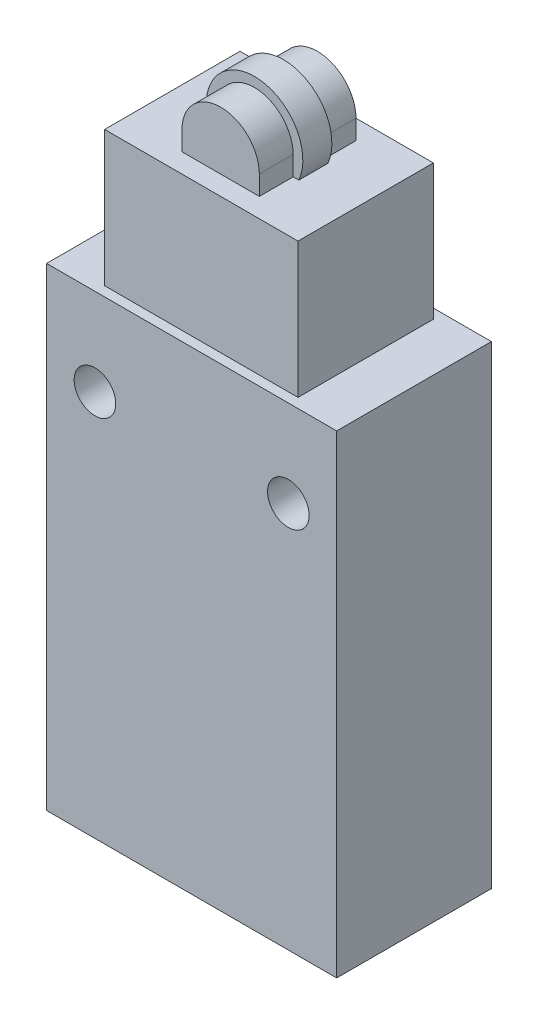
ISO-10303-21;
HEADER;
FILE_DESCRIPTION(('STEP AP214'),'2;1');
FILE_NAME('part.step','',(''),(''),'','','');
FILE_SCHEMA(('AUTOMOTIVE_DESIGN { 1 0 10303 214 1 1 1 1 }'));
ENDSEC;
DATA;
#1=APPLICATION_CONTEXT('core data for automotive mechanical design processes');
#2=APPLICATION_PROTOCOL_DEFINITION('international standard','automotive_design',2000,#1);
#3=PRODUCT_CONTEXT('',#1,'mechanical');
#4=PRODUCT('Part','Part','',(#3));
#5=PRODUCT_RELATED_PRODUCT_CATEGORY('part','',(#4));
#6=PRODUCT_DEFINITION_FORMATION('','',#4);
#7=PRODUCT_DEFINITION_CONTEXT('part definition',#1,'design');
#8=PRODUCT_DEFINITION('design','',#6,#7);
#9=PRODUCT_DEFINITION_SHAPE('','',#8);
#10=(LENGTH_UNIT() NAMED_UNIT(*) SI_UNIT(.MILLI.,.METRE.));
#11=(NAMED_UNIT(*) PLANE_ANGLE_UNIT() SI_UNIT($,.RADIAN.));
#12=(NAMED_UNIT(*) SI_UNIT($,.STERADIAN.) SOLID_ANGLE_UNIT());
#13=UNCERTAINTY_MEASURE_WITH_UNIT(LENGTH_MEASURE(1.E-05),#10,'distance_accuracy_value','');
#14=(GEOMETRIC_REPRESENTATION_CONTEXT(3) GLOBAL_UNCERTAINTY_ASSIGNED_CONTEXT((#13)) GLOBAL_UNIT_ASSIGNED_CONTEXT((#10,
#11,#12)) REPRESENTATION_CONTEXT('',''));
#15=CARTESIAN_POINT('',(0.,0.,0.));
#16=DIRECTION('',(0.,0.,1.));
#17=DIRECTION('',(1.,0.,0.));
#18=AXIS2_PLACEMENT_3D('',#15,#16,#17);
#19=CARTESIAN_POINT('',(14.9999999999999,65.0000000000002,3.));
#20=DIRECTION('',(0.,0.,1.));
#21=DIRECTION('',(1.,0.,0.));
#22=AXIS2_PLACEMENT_3D('',#19,#20,#21);
#23=CYLINDRICAL_SURFACE('',#22,4.);
#24=CARTESIAN_POINT('',(14.9999999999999,65.0000000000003,9.50000000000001));
#25=DIRECTION('',(0.,0.,-1.));
#26=DIRECTION('',(-1.,0.,0.));
#27=AXIS2_PLACEMENT_3D('',#24,#25,#26);
#28=CIRCLE('',#27,4.);
#29=CARTESIAN_POINT('',(10.9999999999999,65.0000000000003,9.50000000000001));
#30=VERTEX_POINT('',#29);
#31=CARTESIAN_POINT('',(19.,65.0000000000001,9.49999999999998));
#32=VERTEX_POINT('',#31);
#33=EDGE_CURVE('E154',#30,#32,#28,.T.);
#34=ORIENTED_EDGE('',*,*,#33,.F.);
#35=DIRECTION('',(0.,0.,1.));
#36=VECTOR('',#35,1.);
#37=CARTESIAN_POINT('',(11.,65.0000000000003,3.));
#38=LINE('',#37,#36);
#39=CARTESIAN_POINT('',(10.9999999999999,65.0000000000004,13.));
#40=VERTEX_POINT('',#39);
#41=EDGE_CURVE('E137',#30,#40,#38,.T.);
#42=ORIENTED_EDGE('',*,*,#41,.T.);
#43=CARTESIAN_POINT('',(14.9999999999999,65.0000000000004,13.));
#44=DIRECTION('',(0.,0.,-1.));
#45=DIRECTION('',(1.,0.,0.));
#46=AXIS2_PLACEMENT_3D('',#43,#44,#45);
#47=CIRCLE('',#46,4.);
#48=CARTESIAN_POINT('',(18.9999999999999,65.0000000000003,13.));
#49=VERTEX_POINT('',#48);
#50=EDGE_CURVE('E210',#40,#49,#47,.T.);
#51=ORIENTED_EDGE('',*,*,#50,.T.);
#52=DIRECTION('',(0.,0.,1.));
#53=VECTOR('',#52,1.);
#54=CARTESIAN_POINT('',(19.,65.0000000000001,3.));
#55=LINE('',#54,#53);
#56=EDGE_CURVE('E155',#32,#49,#55,.T.);
#57=ORIENTED_EDGE('',*,*,#56,.F.);
#58=EDGE_LOOP('',(#34,#42,#51,#57));
#59=FACE_BOUND('',#58,.T.);
#60=ADVANCED_FACE('F16',(#59),#23,.T.);
#61=CARTESIAN_POINT('',(19.,65.0000000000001,3.));
#62=DIRECTION('',(-1.,0.,0.));
#63=DIRECTION('',(0.,0.,1.));
#64=AXIS2_PLACEMENT_3D('',#61,#62,#63);
#65=PLANE('',#64);
#66=DIRECTION('',(0.,-1.,0.));
#67=VECTOR('',#66,1.);
#68=CARTESIAN_POINT('',(19.,65.0000000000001,9.49999999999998));
#69=LINE('',#68,#67);
#70=CARTESIAN_POINT('',(18.9999999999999,63.0000000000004,9.50000000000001));
#71=VERTEX_POINT('',#70);
#72=EDGE_CURVE('E198',#32,#71,#69,.T.);
#73=ORIENTED_EDGE('',*,*,#72,.F.);
#74=ORIENTED_EDGE('',*,*,#56,.T.);
#75=DIRECTION('',(0.,-1.,0.));
#76=VECTOR('',#75,1.);
#77=CARTESIAN_POINT('',(18.9999999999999,65.0000000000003,13.));
#78=LINE('',#77,#76);
#79=CARTESIAN_POINT('',(18.9999999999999,63.0000000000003,13.));
#80=VERTEX_POINT('',#79);
#81=EDGE_CURVE('E212',#49,#80,#78,.T.);
#82=ORIENTED_EDGE('',*,*,#81,.T.);
#83=DIRECTION('',(0.,0.,1.));
#84=VECTOR('',#83,1.);
#85=CARTESIAN_POINT('',(18.9999999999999,63.0000000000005,15.));
#86=LINE('',#85,#84);
#87=EDGE_CURVE('E288',#71,#80,#86,.T.);
#88=ORIENTED_EDGE('',*,*,#87,.F.);
#89=EDGE_LOOP('',(#73,#74,#82,#88));
#90=FACE_BOUND('',#89,.T.);
#91=ADVANCED_FACE('F295',(#90),#65,.F.);
#92=CARTESIAN_POINT('',(11.,55.0000000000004,3.));
#93=DIRECTION('',(1.,0.,0.));
#94=DIRECTION('',(0.,1.,0.));
#95=AXIS2_PLACEMENT_3D('',#92,#93,#94);
#96=PLANE('',#95);
#97=DIRECTION('',(0.,1.,0.));
#98=VECTOR('',#97,1.);
#99=CARTESIAN_POINT('',(11.,55.0000000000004,9.50000000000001));
#100=LINE('',#99,#98);
#101=CARTESIAN_POINT('',(10.9999999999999,63.0000000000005,9.49999999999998));
#102=VERTEX_POINT('',#101);
#103=EDGE_CURVE('E142',#102,#30,#100,.T.);
#104=ORIENTED_EDGE('',*,*,#103,.F.);
#105=DIRECTION('',(0.,0.,-1.));
#106=VECTOR('',#105,1.);
#107=CARTESIAN_POINT('',(10.9999999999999,63.0000000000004,15.));
#108=LINE('',#107,#106);
#109=CARTESIAN_POINT('',(10.9999999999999,63.0000000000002,13.));
#110=VERTEX_POINT('',#109);
#111=EDGE_CURVE('E287',#110,#102,#108,.T.);
#112=ORIENTED_EDGE('',*,*,#111,.F.);
#113=DIRECTION('',(0.,1.,0.));
#114=VECTOR('',#113,1.);
#115=CARTESIAN_POINT('',(11.,55.,13.));
#116=LINE('',#115,#114);
#117=EDGE_CURVE('E145',#110,#40,#116,.T.);
#118=ORIENTED_EDGE('',*,*,#117,.T.);
#119=ORIENTED_EDGE('',*,*,#41,.F.);
#120=EDGE_LOOP('',(#104,#112,#118,#119));
#121=FACE_BOUND('',#120,.T.);
#122=ADVANCED_FACE('F139',(#121),#96,.F.);
#123=CARTESIAN_POINT('',(4.99999999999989,63.0000000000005,15.));
#124=DIRECTION('',(0.,1.,0.));
#125=DIRECTION('',(0.,0.,1.));
#126=AXIS2_PLACEMENT_3D('',#123,#124,#125);
#127=PLANE('',#126);
#128=DIRECTION('',(-1.,0.,0.));
#129=VECTOR('',#128,1.);
#130=CARTESIAN_POINT('',(5.,63.0000000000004,6.49999999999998));
#131=LINE('',#130,#129);
#132=CARTESIAN_POINT('',(19.5825756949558,63.0000000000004,6.50000000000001));
#133=VERTEX_POINT('',#132);
#134=CARTESIAN_POINT('',(19.,63.0000000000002,6.50000000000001));
#135=VERTEX_POINT('',#134);
#136=EDGE_CURVE('E30',#133,#135,#131,.T.);
#137=ORIENTED_EDGE('',*,*,#136,.F.);
#138=DIRECTION('',(0.,0.,1.));
#139=VECTOR('',#138,1.);
#140=CARTESIAN_POINT('',(19.5825756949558,63.0000000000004,6.50000000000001));
#141=LINE('',#140,#139);
#142=CARTESIAN_POINT('',(19.5825756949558,63.0000000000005,9.50000000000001));
#143=VERTEX_POINT('',#142);
#144=EDGE_CURVE('E11',#133,#143,#141,.T.);
#145=ORIENTED_EDGE('',*,*,#144,.T.);
#146=DIRECTION('',(-1.,0.,0.));
#147=VECTOR('',#146,1.);
#148=CARTESIAN_POINT('',(4.99999999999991,63.0000000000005,9.49999999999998));
#149=LINE('',#148,#147);
#150=EDGE_CURVE('E199',#143,#71,#149,.T.);
#151=ORIENTED_EDGE('',*,*,#150,.T.);
#152=ORIENTED_EDGE('',*,*,#87,.T.);
#153=DIRECTION('',(1.,0.,0.));
#154=VECTOR('',#153,1.);
#155=CARTESIAN_POINT('',(4.99999999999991,63.0000000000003,13.));
#156=LINE('',#155,#154);
#157=EDGE_CURVE('E283',#110,#80,#156,.T.);
#158=ORIENTED_EDGE('',*,*,#157,.F.);
#159=ORIENTED_EDGE('',*,*,#111,.T.);
#160=CARTESIAN_POINT('',(10.4174243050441,63.0000000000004,9.50000000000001));
#161=VERTEX_POINT('',#160);
#162=EDGE_CURVE('E158',#102,#161,#149,.T.);
#163=ORIENTED_EDGE('',*,*,#162,.T.);
#164=DIRECTION('',(0.,0.,1.));
#165=VECTOR('',#164,1.);
#166=CARTESIAN_POINT('',(10.4174243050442,63.0000000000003,6.50000000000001));
#167=LINE('',#166,#165);
#168=CARTESIAN_POINT('',(10.4174243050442,63.0000000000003,6.50000000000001));
#169=VERTEX_POINT('',#168);
#170=EDGE_CURVE('E24',#161,#169,#167,.F.);
#171=ORIENTED_EDGE('',*,*,#170,.T.);
#172=CARTESIAN_POINT('',(11.,63.0000000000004,6.49999999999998));
#173=VERTEX_POINT('',#172);
#174=EDGE_CURVE('E175',#173,#169,#131,.T.);
#175=ORIENTED_EDGE('',*,*,#174,.F.);
#176=CARTESIAN_POINT('',(11.,63.0000000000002,2.99999999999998));
#177=VERTEX_POINT('',#176);
#178=EDGE_CURVE('E286',#173,#177,#108,.T.);
#179=ORIENTED_EDGE('',*,*,#178,.T.);
#180=DIRECTION('',(1.,0.,0.));
#181=VECTOR('',#180,1.);
#182=CARTESIAN_POINT('',(5.,63.0000000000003,3.));
#183=LINE('',#182,#181);
#184=CARTESIAN_POINT('',(19.,63.,3.));
#185=VERTEX_POINT('',#184);
#186=EDGE_CURVE('E165',#177,#185,#183,.T.);
#187=ORIENTED_EDGE('',*,*,#186,.T.);
#188=EDGE_CURVE('E168',#185,#135,#86,.T.);
#189=ORIENTED_EDGE('',*,*,#188,.T.);
#190=EDGE_LOOP('',(#137,#145,#151,#152,#158,#159,#163,#171,#175,#179,#187,#189));
#191=FACE_BOUND('',#190,.T.);
#192=DIRECTION('',(0.,0.,1.));
#193=VECTOR('',#192,1.);
#194=CARTESIAN_POINT('',(5.,63.0000000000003,1.));
#195=LINE('',#194,#193);
#196=CARTESIAN_POINT('',(5.,63.0000000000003,1.));
#197=VERTEX_POINT('',#196);
#198=CARTESIAN_POINT('',(4.99999999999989,63.0000000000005,15.));
#199=VERTEX_POINT('',#198);
#200=EDGE_CURVE('E232',#197,#199,#195,.T.);
#201=ORIENTED_EDGE('',*,*,#200,.T.);
#202=DIRECTION('',(1.,0.,0.));
#203=VECTOR('',#202,1.);
#204=CARTESIAN_POINT('',(4.99999999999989,63.0000000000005,15.));
#205=LINE('',#204,#203);
#206=CARTESIAN_POINT('',(24.9999999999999,63.0000000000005,15.));
#207=VERTEX_POINT('',#206);
#208=EDGE_CURVE('E235',#199,#207,#205,.T.);
#209=ORIENTED_EDGE('',*,*,#208,.T.);
#210=DIRECTION('',(0.,0.,-1.));
#211=VECTOR('',#210,1.);
#212=CARTESIAN_POINT('',(25.,63.0000000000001,1.));
#213=LINE('',#212,#211);
#214=CARTESIAN_POINT('',(25.,63.0000000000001,1.));
#215=VERTEX_POINT('',#214);
#216=EDGE_CURVE('E237',#207,#215,#213,.T.);
#217=ORIENTED_EDGE('',*,*,#216,.T.);
#218=DIRECTION('',(-1.,0.,0.));
#219=VECTOR('',#218,1.);
#220=CARTESIAN_POINT('',(5.,63.0000000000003,1.));
#221=LINE('',#220,#219);
#222=EDGE_CURVE('E239',#215,#197,#221,.T.);
#223=ORIENTED_EDGE('',*,*,#222,.T.);
#224=EDGE_LOOP('',(#201,#209,#217,#223));
#225=FACE_BOUND('',#224,.T.);
#226=ADVANCED_FACE('F173',(#191,#225),#127,.T.);
#227=CARTESIAN_POINT('',(0.,49.,16.));
#228=DIRECTION('',(0.,-1.,0.));
#229=DIRECTION('',(0.,0.,-1.));
#230=AXIS2_PLACEMENT_3D('',#227,#228,#229);
#231=PLANE('',#230);
#232=DIRECTION('',(-1.,0.,0.));
#233=VECTOR('',#232,1.);
#234=CARTESIAN_POINT('',(-1.04083408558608E-13,49.0000000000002,0.));
#235=LINE('',#234,#233);
#236=CARTESIAN_POINT('',(29.9999999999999,49.0000000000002,0.));
#237=VERTEX_POINT('',#236);
#238=CARTESIAN_POINT('',(-1.04083408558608E-13,49.0000000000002,0.));
#239=VERTEX_POINT('',#238);
#240=EDGE_CURVE('E260',#237,#239,#235,.T.);
#241=ORIENTED_EDGE('',*,*,#240,.T.);
#242=DIRECTION('',(0.,0.,-1.));
#243=VECTOR('',#242,1.);
#244=CARTESIAN_POINT('',(0.,49.,16.));
#245=LINE('',#244,#243);
#246=CARTESIAN_POINT('',(0.,49.,16.));
#247=VERTEX_POINT('',#246);
#248=EDGE_CURVE('E271',#247,#239,#245,.T.);
#249=ORIENTED_EDGE('',*,*,#248,.F.);
#250=DIRECTION('',(-1.,0.,0.));
#251=VECTOR('',#250,1.);
#252=CARTESIAN_POINT('',(0.,49.,16.));
#253=LINE('',#252,#251);
#254=CARTESIAN_POINT('',(30.,49.,16.));
#255=VERTEX_POINT('',#254);
#256=EDGE_CURVE('E269',#255,#247,#253,.T.);
#257=ORIENTED_EDGE('',*,*,#256,.F.);
#258=DIRECTION('',(0.,0.,-1.));
#259=VECTOR('',#258,1.);
#260=CARTESIAN_POINT('',(30.,49.,16.));
#261=LINE('',#260,#259);
#262=EDGE_CURVE('E274',#255,#237,#261,.T.);
#263=ORIENTED_EDGE('',*,*,#262,.T.);
#264=EDGE_LOOP('',(#241,#249,#257,#263));
#265=FACE_BOUND('',#264,.T.);
#266=DIRECTION('',(0.,0.,1.));
#267=VECTOR('',#266,1.);
#268=CARTESIAN_POINT('',(4.99999999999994,49.0000000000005,1.));
#269=LINE('',#268,#267);
#270=CARTESIAN_POINT('',(4.99999999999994,49.0000000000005,1.));
#271=VERTEX_POINT('',#270);
#272=CARTESIAN_POINT('',(4.99999999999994,49.0000000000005,15.));
#273=VERTEX_POINT('',#272);
#274=EDGE_CURVE('E220',#271,#273,#269,.T.);
#275=ORIENTED_EDGE('',*,*,#274,.F.);
#276=DIRECTION('',(-1.,0.,0.));
#277=VECTOR('',#276,1.);
#278=CARTESIAN_POINT('',(4.99999999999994,49.0000000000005,1.));
#279=LINE('',#278,#277);
#280=CARTESIAN_POINT('',(24.9999999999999,49.0000000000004,0.999999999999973));
#281=VERTEX_POINT('',#280);
#282=EDGE_CURVE('E229',#281,#271,#279,.T.);
#283=ORIENTED_EDGE('',*,*,#282,.F.);
#284=DIRECTION('',(0.,0.,-1.));
#285=VECTOR('',#284,1.);
#286=CARTESIAN_POINT('',(24.9999999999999,49.0000000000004,0.999999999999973));
#287=LINE('',#286,#285);
#288=CARTESIAN_POINT('',(24.9999999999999,49.0000000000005,15.));
#289=VERTEX_POINT('',#288);
#290=EDGE_CURVE('E226',#289,#281,#287,.T.);
#291=ORIENTED_EDGE('',*,*,#290,.F.);
#292=DIRECTION('',(1.,0.,0.));
#293=VECTOR('',#292,1.);
#294=CARTESIAN_POINT('',(4.99999999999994,49.0000000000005,15.));
#295=LINE('',#294,#293);
#296=EDGE_CURVE('E223',#273,#289,#295,.T.);
#297=ORIENTED_EDGE('',*,*,#296,.F.);
#298=EDGE_LOOP('',(#275,#283,#291,#297));
#299=FACE_BOUND('',#298,.T.);
#300=ADVANCED_FACE('F385',(#265,#299),#231,.F.);
#301=CARTESIAN_POINT('',(0.,6.93889390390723E-13,16.));
#302=DIRECTION('',(1.,0.,0.));
#303=DIRECTION('',(0.,0.,-1.));
#304=AXIS2_PLACEMENT_3D('',#301,#302,#303);
#305=PLANE('',#304);
#306=DIRECTION('',(0.,-1.,0.));
#307=VECTOR('',#306,1.);
#308=CARTESIAN_POINT('',(0.,6.38378239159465E-13,0.));
#309=LINE('',#308,#307);
#310=CARTESIAN_POINT('',(0.,6.38378239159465E-13,0.));
#311=VERTEX_POINT('',#310);
#312=EDGE_CURVE('E253',#239,#311,#309,.T.);
#313=ORIENTED_EDGE('',*,*,#312,.T.);
#314=DIRECTION('',(0.,0.,-1.));
#315=VECTOR('',#314,1.);
#316=CARTESIAN_POINT('',(0.,6.93889390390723E-13,16.));
#317=LINE('',#316,#315);
#318=CARTESIAN_POINT('',(0.,6.93889390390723E-13,16.));
#319=VERTEX_POINT('',#318);
#320=EDGE_CURVE('E280',#319,#311,#317,.T.);
#321=ORIENTED_EDGE('',*,*,#320,.F.);
#322=DIRECTION('',(0.,-1.,0.));
#323=VECTOR('',#322,1.);
#324=CARTESIAN_POINT('',(0.,6.93889390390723E-13,16.));
#325=LINE('',#324,#323);
#326=EDGE_CURVE('E262',#247,#319,#325,.T.);
#327=ORIENTED_EDGE('',*,*,#326,.F.);
#328=ORIENTED_EDGE('',*,*,#248,.T.);
#329=EDGE_LOOP('',(#313,#321,#327,#328));
#330=FACE_BOUND('',#329,.T.);
#331=ADVANCED_FACE('F18',(#330),#305,.F.);
#332=CARTESIAN_POINT('',(0.,6.93889390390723E-13,16.));
#333=DIRECTION('',(0.,1.,0.));
#334=DIRECTION('',(0.,0.,1.));
#335=AXIS2_PLACEMENT_3D('',#332,#333,#334);
#336=PLANE('',#335);
#337=DIRECTION('',(1.,0.,0.));
#338=VECTOR('',#337,1.);
#339=CARTESIAN_POINT('',(0.,6.38378239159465E-13,0.));
#340=LINE('',#339,#338);
#341=CARTESIAN_POINT('',(29.9999999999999,6.38378239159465E-13,0.));
#342=VERTEX_POINT('',#341);
#343=EDGE_CURVE('E256',#311,#342,#340,.T.);
#344=ORIENTED_EDGE('',*,*,#343,.T.);
#345=DIRECTION('',(0.,0.,-1.));
#346=VECTOR('',#345,1.);
#347=CARTESIAN_POINT('',(30.,1.11022302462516E-13,16.));
#348=LINE('',#347,#346);
#349=CARTESIAN_POINT('',(30.,1.11022302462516E-13,16.));
#350=VERTEX_POINT('',#349);
#351=EDGE_CURVE('E277',#350,#342,#348,.T.);
#352=ORIENTED_EDGE('',*,*,#351,.F.);
#353=DIRECTION('',(1.,0.,0.));
#354=VECTOR('',#353,1.);
#355=CARTESIAN_POINT('',(0.,6.93889390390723E-13,16.));
#356=LINE('',#355,#354);
#357=EDGE_CURVE('E265',#319,#350,#356,.T.);
#358=ORIENTED_EDGE('',*,*,#357,.F.);
#359=ORIENTED_EDGE('',*,*,#320,.T.);
#360=EDGE_LOOP('',(#344,#352,#358,#359));
#361=FACE_BOUND('',#360,.T.);
#362=ADVANCED_FACE('F378',(#361),#336,.F.);
#363=CARTESIAN_POINT('',(30.,1.11022302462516E-13,16.));
#364=DIRECTION('',(-1.,0.,0.));
#365=DIRECTION('',(0.,0.,1.));
#366=AXIS2_PLACEMENT_3D('',#363,#364,#365);
#367=PLANE('',#366);
#368=DIRECTION('',(0.,1.,0.));
#369=VECTOR('',#368,1.);
#370=CARTESIAN_POINT('',(29.9999999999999,6.38378239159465E-13,0.));
#371=LINE('',#370,#369);
#372=EDGE_CURVE('E258',#342,#237,#371,.T.);
#373=ORIENTED_EDGE('',*,*,#372,.T.);
#374=ORIENTED_EDGE('',*,*,#262,.F.);
#375=DIRECTION('',(0.,1.,0.));
#376=VECTOR('',#375,1.);
#377=CARTESIAN_POINT('',(30.,1.11022302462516E-13,16.));
#378=LINE('',#377,#376);
#379=EDGE_CURVE('E267',#350,#255,#378,.T.);
#380=ORIENTED_EDGE('',*,*,#379,.F.);
#381=ORIENTED_EDGE('',*,*,#351,.T.);
#382=EDGE_LOOP('',(#373,#374,#380,#381));
#383=FACE_BOUND('',#382,.T.);
#384=ADVANCED_FACE('F368',(#383),#367,.F.);
#385=CARTESIAN_POINT('',(0.,49.,16.));
#386=DIRECTION('',(0.,0.,-1.));
#387=DIRECTION('',(-1.,0.,0.));
#388=AXIS2_PLACEMENT_3D('',#385,#386,#387);
#389=PLANE('',#388);
#390=CARTESIAN_POINT('',(25.,40.0000000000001,16.));
#391=DIRECTION('',(0.,0.,1.));
#392=DIRECTION('',(1.,0.,0.));
#393=AXIS2_PLACEMENT_3D('',#390,#391,#392);
#394=CIRCLE('',#393,2.15);
#395=CARTESIAN_POINT('',(27.15,40.0000000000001,16.));
#396=VERTEX_POINT('',#395);
#397=EDGE_CURVE('E353',#396,#396,#394,.T.);
#398=ORIENTED_EDGE('',*,*,#397,.F.);
#399=EDGE_LOOP('',(#398));
#400=FACE_BOUND('',#399,.T.);
#401=CARTESIAN_POINT('',(4.99999999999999,40.,16.));
#402=DIRECTION('',(0.,0.,1.));
#403=DIRECTION('',(1.,0.,0.));
#404=AXIS2_PLACEMENT_3D('',#401,#402,#403);
#405=CIRCLE('',#404,2.15);
#406=CARTESIAN_POINT('',(7.14999999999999,40.,16.));
#407=VERTEX_POINT('',#406);
#408=EDGE_CURVE('E194',#407,#407,#405,.T.);
#409=ORIENTED_EDGE('',*,*,#408,.F.);
#410=EDGE_LOOP('',(#409));
#411=FACE_BOUND('',#410,.T.);
#412=ORIENTED_EDGE('',*,*,#326,.T.);
#413=ORIENTED_EDGE('',*,*,#357,.T.);
#414=ORIENTED_EDGE('',*,*,#379,.T.);
#415=ORIENTED_EDGE('',*,*,#256,.T.);
#416=EDGE_LOOP('',(#412,#413,#414,#415));
#417=FACE_BOUND('',#416,.T.);
#418=ADVANCED_FACE('F364',(#400,#411,#417),#389,.F.);
#419=CARTESIAN_POINT('',(-1.04083408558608E-13,49.0000000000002,0.));
#420=DIRECTION('',(0.,0.,-1.));
#421=DIRECTION('',(-1.,0.,0.));
#422=AXIS2_PLACEMENT_3D('',#419,#420,#421);
#423=PLANE('',#422);
#424=CARTESIAN_POINT('',(25.,40.,0.));
#425=DIRECTION('',(0.,0.,1.));
#426=DIRECTION('',(1.,0.,0.));
#427=AXIS2_PLACEMENT_3D('',#424,#425,#426);
#428=CIRCLE('',#427,2.15);
#429=CARTESIAN_POINT('',(27.15,40.,0.));
#430=VERTEX_POINT('',#429);
#431=EDGE_CURVE('E350',#430,#430,#428,.T.);
#432=ORIENTED_EDGE('',*,*,#431,.T.);
#433=EDGE_LOOP('',(#432));
#434=FACE_BOUND('',#433,.T.);
#435=CARTESIAN_POINT('',(4.99999999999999,40.,0.));
#436=DIRECTION('',(0.,0.,1.));
#437=DIRECTION('',(1.,0.,0.));
#438=AXIS2_PLACEMENT_3D('',#435,#436,#437);
#439=CIRCLE('',#438,2.15);
#440=CARTESIAN_POINT('',(7.14999999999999,40.,0.));
#441=VERTEX_POINT('',#440);
#442=EDGE_CURVE('E191',#441,#441,#439,.T.);
#443=ORIENTED_EDGE('',*,*,#442,.T.);
#444=EDGE_LOOP('',(#443));
#445=FACE_BOUND('',#444,.T.);
#446=ORIENTED_EDGE('',*,*,#312,.F.);
#447=ORIENTED_EDGE('',*,*,#240,.F.);
#448=ORIENTED_EDGE('',*,*,#372,.F.);
#449=ORIENTED_EDGE('',*,*,#343,.F.);
#450=EDGE_LOOP('',(#446,#447,#448,#449));
#451=FACE_BOUND('',#450,.T.);
#452=ADVANCED_FACE('F367',(#434,#445,#451),#423,.T.);
#453=CARTESIAN_POINT('',(5.,63.0000000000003,1.));
#454=DIRECTION('',(1.,0.,0.));
#455=DIRECTION('',(0.,0.,-1.));
#456=AXIS2_PLACEMENT_3D('',#453,#454,#455);
#457=PLANE('',#456);
#458=ORIENTED_EDGE('',*,*,#274,.T.);
#459=DIRECTION('',(0.,-1.,0.));
#460=VECTOR('',#459,1.);
#461=CARTESIAN_POINT('',(4.99999999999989,63.0000000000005,15.));
#462=LINE('',#461,#460);
#463=EDGE_CURVE('E250',#199,#273,#462,.T.);
#464=ORIENTED_EDGE('',*,*,#463,.F.);
#465=ORIENTED_EDGE('',*,*,#200,.F.);
#466=DIRECTION('',(0.,-1.,0.));
#467=VECTOR('',#466,1.);
#468=CARTESIAN_POINT('',(5.,63.0000000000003,1.));
#469=LINE('',#468,#467);
#470=EDGE_CURVE('E241',#197,#271,#469,.T.);
#471=ORIENTED_EDGE('',*,*,#470,.T.);
#472=EDGE_LOOP('',(#458,#464,#465,#471));
#473=FACE_BOUND('',#472,.T.);
#474=ADVANCED_FACE('F389',(#473),#457,.F.);
#475=CARTESIAN_POINT('',(4.99999999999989,63.0000000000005,15.));
#476=DIRECTION('',(0.,0.,-1.));
#477=DIRECTION('',(-1.,0.,0.));
#478=AXIS2_PLACEMENT_3D('',#475,#476,#477);
#479=PLANE('',#478);
#480=ORIENTED_EDGE('',*,*,#296,.T.);
#481=DIRECTION('',(0.,-1.,0.));
#482=VECTOR('',#481,1.);
#483=CARTESIAN_POINT('',(24.9999999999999,63.0000000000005,15.));
#484=LINE('',#483,#482);
#485=EDGE_CURVE('E247',#207,#289,#484,.T.);
#486=ORIENTED_EDGE('',*,*,#485,.F.);
#487=ORIENTED_EDGE('',*,*,#208,.F.);
#488=ORIENTED_EDGE('',*,*,#463,.T.);
#489=EDGE_LOOP('',(#480,#486,#487,#488));
#490=FACE_BOUND('',#489,.T.);
#491=ADVANCED_FACE('F395',(#490),#479,.F.);
#492=CARTESIAN_POINT('',(25.,63.0000000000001,1.));
#493=DIRECTION('',(-1.,0.,0.));
#494=DIRECTION('',(0.,0.,1.));
#495=AXIS2_PLACEMENT_3D('',#492,#493,#494);
#496=PLANE('',#495);
#497=ORIENTED_EDGE('',*,*,#290,.T.);
#498=DIRECTION('',(0.,-1.,0.));
#499=VECTOR('',#498,1.);
#500=CARTESIAN_POINT('',(25.,63.0000000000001,1.));
#501=LINE('',#500,#499);
#502=EDGE_CURVE('E244',#215,#281,#501,.T.);
#503=ORIENTED_EDGE('',*,*,#502,.F.);
#504=ORIENTED_EDGE('',*,*,#216,.F.);
#505=ORIENTED_EDGE('',*,*,#485,.T.);
#506=EDGE_LOOP('',(#497,#503,#504,#505));
#507=FACE_BOUND('',#506,.T.);
#508=ADVANCED_FACE('F439',(#507),#496,.F.);
#509=CARTESIAN_POINT('',(5.,63.0000000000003,1.));
#510=DIRECTION('',(0.,0.,1.));
#511=DIRECTION('',(1.,0.,0.));
#512=AXIS2_PLACEMENT_3D('',#509,#510,#511);
#513=PLANE('',#512);
#514=ORIENTED_EDGE('',*,*,#282,.T.);
#515=ORIENTED_EDGE('',*,*,#470,.F.);
#516=ORIENTED_EDGE('',*,*,#222,.F.);
#517=ORIENTED_EDGE('',*,*,#502,.T.);
#518=EDGE_LOOP('',(#514,#515,#516,#517));
#519=FACE_BOUND('',#518,.T.);
#520=ADVANCED_FACE('F316',(#519),#513,.F.);
#521=CARTESIAN_POINT('',(11.,65.0000000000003,3.));
#522=VERTEX_POINT('',#521);
#523=CARTESIAN_POINT('',(11.,65.,6.50000000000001));
#524=VERTEX_POINT('',#523);
#525=EDGE_CURVE('E149',#522,#524,#38,.T.);
#526=ORIENTED_EDGE('',*,*,#525,.T.);
#527=CARTESIAN_POINT('',(15.,65.,6.50000000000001));
#528=DIRECTION('',(0.,0.,-1.));
#529=DIRECTION('',(-1.,0.,0.));
#530=AXIS2_PLACEMENT_3D('',#527,#528,#529);
#531=CIRCLE('',#530,4.);
#532=CARTESIAN_POINT('',(19.,65.,6.49999999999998));
#533=VERTEX_POINT('',#532);
#534=EDGE_CURVE('E186',#524,#533,#531,.T.);
#535=ORIENTED_EDGE('',*,*,#534,.T.);
#536=CARTESIAN_POINT('',(19.,65.0000000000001,3.));
#537=VERTEX_POINT('',#536);
#538=EDGE_CURVE('E217',#537,#533,#55,.T.);
#539=ORIENTED_EDGE('',*,*,#538,.F.);
#540=CARTESIAN_POINT('',(14.9999999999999,65.0000000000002,3.));
#541=DIRECTION('',(0.,0.,-1.));
#542=DIRECTION('',(1.,0.,0.));
#543=AXIS2_PLACEMENT_3D('',#540,#541,#542);
#544=CIRCLE('',#543,4.);
#545=EDGE_CURVE('E203',#522,#537,#544,.T.);
#546=ORIENTED_EDGE('',*,*,#545,.F.);
#547=EDGE_LOOP('',(#526,#535,#539,#546));
#548=FACE_BOUND('',#547,.T.);
#549=ADVANCED_FACE('F307',(#548),#23,.T.);
#550=ORIENTED_EDGE('',*,*,#538,.T.);
#551=DIRECTION('',(0.,-1.,0.));
#552=VECTOR('',#551,1.);
#553=CARTESIAN_POINT('',(19.,65.,6.49999999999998));
#554=LINE('',#553,#552);
#555=EDGE_CURVE('E185',#533,#135,#554,.T.);
#556=ORIENTED_EDGE('',*,*,#555,.T.);
#557=ORIENTED_EDGE('',*,*,#188,.F.);
#558=DIRECTION('',(0.,-1.,0.));
#559=VECTOR('',#558,1.);
#560=CARTESIAN_POINT('',(19.,65.0000000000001,3.));
#561=LINE('',#560,#559);
#562=EDGE_CURVE('E206',#537,#185,#561,.T.);
#563=ORIENTED_EDGE('',*,*,#562,.F.);
#564=EDGE_LOOP('',(#550,#556,#557,#563));
#565=FACE_BOUND('',#564,.T.);
#566=ADVANCED_FACE('F298',(#565),#65,.F.);
#567=ORIENTED_EDGE('',*,*,#178,.F.);
#568=DIRECTION('',(0.,1.,0.));
#569=VECTOR('',#568,1.);
#570=CARTESIAN_POINT('',(10.9999999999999,55.0000000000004,6.50000000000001));
#571=LINE('',#570,#569);
#572=EDGE_CURVE('E164',#173,#524,#571,.T.);
#573=ORIENTED_EDGE('',*,*,#572,.T.);
#574=ORIENTED_EDGE('',*,*,#525,.F.);
#575=DIRECTION('',(0.,1.,0.));
#576=VECTOR('',#575,1.);
#577=CARTESIAN_POINT('',(11.,55.0000000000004,3.));
#578=LINE('',#577,#576);
#579=EDGE_CURVE('E150',#177,#522,#578,.T.);
#580=ORIENTED_EDGE('',*,*,#579,.F.);
#581=EDGE_LOOP('',(#567,#573,#574,#580));
#582=FACE_BOUND('',#581,.T.);
#583=ADVANCED_FACE('F305',(#582),#96,.F.);
#584=CARTESIAN_POINT('',(14.9999999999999,65.0000000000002,3.));
#585=DIRECTION('',(0.,0.,1.));
#586=DIRECTION('',(1.,0.,0.));
#587=AXIS2_PLACEMENT_3D('',#584,#585,#586);
#588=PLANE('',#587);
#589=ORIENTED_EDGE('',*,*,#186,.F.);
#590=ORIENTED_EDGE('',*,*,#579,.T.);
#591=ORIENTED_EDGE('',*,*,#545,.T.);
#592=ORIENTED_EDGE('',*,*,#562,.T.);
#593=EDGE_LOOP('',(#589,#590,#591,#592));
#594=FACE_BOUND('',#593,.T.);
#595=ADVANCED_FACE('F314',(#594),#588,.F.);
#596=CARTESIAN_POINT('',(14.9999999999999,65.0000000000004,13.));
#597=DIRECTION('',(0.,0.,1.));
#598=DIRECTION('',(1.,0.,0.));
#599=AXIS2_PLACEMENT_3D('',#596,#597,#598);
#600=PLANE('',#599);
#601=ORIENTED_EDGE('',*,*,#117,.F.);
#602=ORIENTED_EDGE('',*,*,#157,.T.);
#603=ORIENTED_EDGE('',*,*,#81,.F.);
#604=ORIENTED_EDGE('',*,*,#50,.F.);
#605=EDGE_LOOP('',(#601,#602,#603,#604));
#606=FACE_BOUND('',#605,.T.);
#607=ADVANCED_FACE('F294',(#606),#600,.T.);
#608=CARTESIAN_POINT('',(15.,65.,6.50000000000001));
#609=DIRECTION('',(0.,0.,1.));
#610=DIRECTION('',(1.,0.,0.));
#611=AXIS2_PLACEMENT_3D('',#608,#609,#610);
#612=CYLINDRICAL_SURFACE('',#611,5.);
#613=ORIENTED_EDGE('',*,*,#170,.F.);
#614=CARTESIAN_POINT('',(14.9999999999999,65.0000000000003,9.50000000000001));
#615=DIRECTION('',(0.,0.,-1.));
#616=DIRECTION('',(-1.,0.,0.));
#617=AXIS2_PLACEMENT_3D('',#614,#615,#616);
#618=CIRCLE('',#617,5.);
#619=EDGE_CURVE('E189',#161,#143,#618,.T.);
#620=ORIENTED_EDGE('',*,*,#619,.T.);
#621=ORIENTED_EDGE('',*,*,#144,.F.);
#622=CARTESIAN_POINT('',(15.,65.,6.50000000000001));
#623=DIRECTION('',(0.,0.,-1.));
#624=DIRECTION('',(-1.,0.,0.));
#625=AXIS2_PLACEMENT_3D('',#622,#623,#624);
#626=CIRCLE('',#625,5.);
#627=EDGE_CURVE('E159',#169,#133,#626,.T.);
#628=ORIENTED_EDGE('',*,*,#627,.F.);
#629=EDGE_LOOP('',(#613,#620,#621,#628));
#630=FACE_BOUND('',#629,.T.);
#631=ADVANCED_FACE('F188',(#630),#612,.T.);
#632=CARTESIAN_POINT('',(15.,65.,6.50000000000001));
#633=DIRECTION('',(0.,0.,-1.));
#634=DIRECTION('',(-1.,0.,0.));
#635=AXIS2_PLACEMENT_3D('',#632,#633,#634);
#636=PLANE('',#635);
#637=ORIENTED_EDGE('',*,*,#627,.T.);
#638=ORIENTED_EDGE('',*,*,#136,.T.);
#639=ORIENTED_EDGE('',*,*,#555,.F.);
#640=ORIENTED_EDGE('',*,*,#534,.F.);
#641=ORIENTED_EDGE('',*,*,#572,.F.);
#642=ORIENTED_EDGE('',*,*,#174,.T.);
#643=EDGE_LOOP('',(#637,#638,#639,#640,#641,#642));
#644=FACE_BOUND('',#643,.T.);
#645=ADVANCED_FACE('F183',(#644),#636,.T.);
#646=CARTESIAN_POINT('',(14.9999999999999,65.0000000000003,9.50000000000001));
#647=DIRECTION('',(0.,0.,-1.));
#648=DIRECTION('',(-1.,0.,0.));
#649=AXIS2_PLACEMENT_3D('',#646,#647,#648);
#650=PLANE('',#649);
#651=ORIENTED_EDGE('',*,*,#150,.F.);
#652=ORIENTED_EDGE('',*,*,#619,.F.);
#653=ORIENTED_EDGE('',*,*,#162,.F.);
#654=ORIENTED_EDGE('',*,*,#103,.T.);
#655=ORIENTED_EDGE('',*,*,#33,.T.);
#656=ORIENTED_EDGE('',*,*,#72,.T.);
#657=EDGE_LOOP('',(#651,#652,#653,#654,#655,#656));
#658=FACE_BOUND('',#657,.T.);
#659=ADVANCED_FACE('F162',(#658),#650,.F.);
#660=CARTESIAN_POINT('',(4.99999999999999,40.,0.));
#661=DIRECTION('',(0.,0.,1.));
#662=DIRECTION('',(1.,0.,0.));
#663=AXIS2_PLACEMENT_3D('',#660,#661,#662);
#664=CYLINDRICAL_SURFACE('',#663,2.15);
#665=ORIENTED_EDGE('',*,*,#442,.F.);
#666=EDGE_LOOP('',(#665));
#667=FACE_BOUND('',#666,.T.);
#668=ORIENTED_EDGE('',*,*,#408,.T.);
#669=EDGE_LOOP('',(#668));
#670=FACE_BOUND('',#669,.T.);
#671=ADVANCED_FACE('F336',(#667,#670),#664,.F.);
#672=CARTESIAN_POINT('',(25.,40.,0.));
#673=DIRECTION('',(0.,0.,1.));
#674=DIRECTION('',(1.,0.,0.));
#675=AXIS2_PLACEMENT_3D('',#672,#673,#674);
#676=CYLINDRICAL_SURFACE('',#675,2.15);
#677=ORIENTED_EDGE('',*,*,#431,.F.);
#678=EDGE_LOOP('',(#677));
#679=FACE_BOUND('',#678,.T.);
#680=ORIENTED_EDGE('',*,*,#397,.T.);
#681=EDGE_LOOP('',(#680));
#682=FACE_BOUND('',#681,.T.);
#683=ADVANCED_FACE('F341',(#679,#682),#676,.F.);
#684=CLOSED_SHELL('',(#60,#91,#122,#226,#300,#331,#362,#384,#418,#452,#474,#491,#508,#520,#549,
#566,#583,#595,#607,#631,#645,#659,#671,#683));
#685=MANIFOLD_SOLID_BREP('B1',#684);
#686=ADVANCED_BREP_SHAPE_REPRESENTATION('',(#18,#685),#14);
#687=SHAPE_DEFINITION_REPRESENTATION(#9,#686);
ENDSEC;
END-ISO-10303-21;
